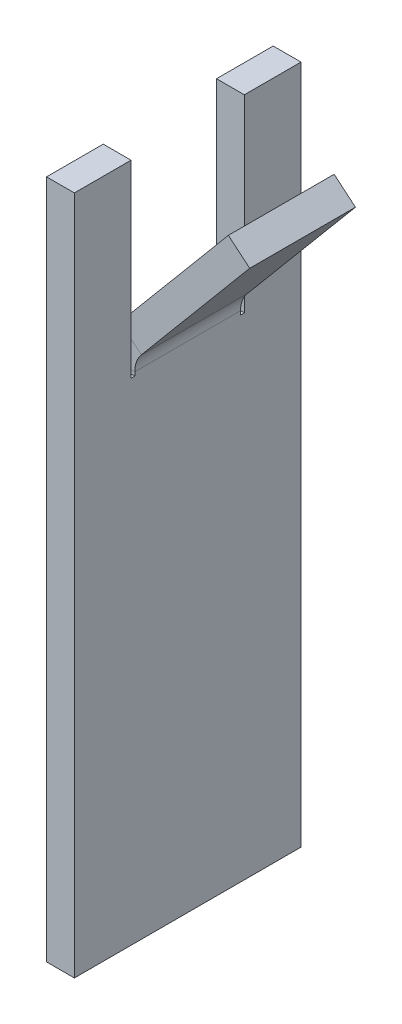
ISO-10303-21;
HEADER;
FILE_DESCRIPTION(('STEP AP214'),'2;1');
FILE_NAME('part.step','',(''),(''),'','','');
FILE_SCHEMA(('AUTOMOTIVE_DESIGN { 1 0 10303 214 1 1 1 1 }'));
ENDSEC;
DATA;
#1=APPLICATION_CONTEXT('core data for automotive mechanical design processes');
#2=APPLICATION_PROTOCOL_DEFINITION('international standard','automotive_design',2000,#1);
#3=PRODUCT_CONTEXT('',#1,'mechanical');
#4=PRODUCT('Part','Part','',(#3));
#5=PRODUCT_RELATED_PRODUCT_CATEGORY('part','',(#4));
#6=PRODUCT_DEFINITION_FORMATION('','',#4);
#7=PRODUCT_DEFINITION_CONTEXT('part definition',#1,'design');
#8=PRODUCT_DEFINITION('design','',#6,#7);
#9=PRODUCT_DEFINITION_SHAPE('','',#8);
#10=(LENGTH_UNIT() NAMED_UNIT(*) SI_UNIT(.MILLI.,.METRE.));
#11=(NAMED_UNIT(*) PLANE_ANGLE_UNIT() SI_UNIT($,.RADIAN.));
#12=(NAMED_UNIT(*) SI_UNIT($,.STERADIAN.) SOLID_ANGLE_UNIT());
#13=UNCERTAINTY_MEASURE_WITH_UNIT(LENGTH_MEASURE(1.E-05),#10,'distance_accuracy_value','');
#14=(GEOMETRIC_REPRESENTATION_CONTEXT(3) GLOBAL_UNCERTAINTY_ASSIGNED_CONTEXT((#13)) GLOBAL_UNIT_ASSIGNED_CONTEXT((#10,
#11,#12)) REPRESENTATION_CONTEXT('',''));
#15=CARTESIAN_POINT('',(0.,0.,0.));
#16=DIRECTION('',(0.,0.,1.));
#17=DIRECTION('',(1.,0.,0.));
#18=AXIS2_PLACEMENT_3D('',#15,#16,#17);
#19=CARTESIAN_POINT('',(-0.7366,0.,0.));
#20=DIRECTION('',(0.,0.,1.));
#21=DIRECTION('',(1.,0.,0.));
#22=AXIS2_PLACEMENT_3D('',#19,#20,#21);
#23=PLANE('',#22);
#24=DIRECTION('',(0.,-1.,0.));
#25=VECTOR('',#24,1.);
#26=CARTESIAN_POINT('',(0.,0.,0.));
#27=LINE('',#26,#25);
#28=CARTESIAN_POINT('',(0.,18.,0.));
#29=VERTEX_POINT('',#28);
#30=CARTESIAN_POINT('',(0.,0.,0.));
#31=VERTEX_POINT('',#30);
#32=EDGE_CURVE('E175',#29,#31,#27,.T.);
#33=ORIENTED_EDGE('',*,*,#32,.F.);
#34=DIRECTION('',(1.,0.,0.));
#35=VECTOR('',#34,1.);
#36=CARTESIAN_POINT('',(-0.7366,18.,0.));
#37=LINE('',#36,#35);
#38=CARTESIAN_POINT('',(-0.7366,18.,0.));
#39=VERTEX_POINT('',#38);
#40=EDGE_CURVE('E13',#39,#29,#37,.T.);
#41=ORIENTED_EDGE('',*,*,#40,.F.);
#42=DIRECTION('',(0.,-1.,0.));
#43=VECTOR('',#42,1.);
#44=CARTESIAN_POINT('',(-0.7366,0.,0.));
#45=LINE('',#44,#43);
#46=CARTESIAN_POINT('',(-0.7366,0.,0.));
#47=VERTEX_POINT('',#46);
#48=EDGE_CURVE('E208',#39,#47,#45,.T.);
#49=ORIENTED_EDGE('',*,*,#48,.T.);
#50=DIRECTION('',(1.,0.,0.));
#51=VECTOR('',#50,1.);
#52=CARTESIAN_POINT('',(-0.7366,0.,0.));
#53=LINE('',#52,#51);
#54=EDGE_CURVE('E56',#47,#31,#53,.T.);
#55=ORIENTED_EDGE('',*,*,#54,.T.);
#56=EDGE_LOOP('',(#33,#41,#49,#55));
#57=FACE_BOUND('',#56,.T.);
#58=ADVANCED_FACE('F53',(#57),#23,.T.);
#59=CARTESIAN_POINT('',(-0.7366,18.,0.));
#60=DIRECTION('',(0.,1.,0.));
#61=DIRECTION('',(0.,0.,1.));
#62=AXIS2_PLACEMENT_3D('',#59,#60,#61);
#63=PLANE('',#62);
#64=DIRECTION('',(0.,0.,1.));
#65=VECTOR('',#64,1.);
#66=CARTESIAN_POINT('',(0.,18.,0.));
#67=LINE('',#66,#65);
#68=CARTESIAN_POINT('',(0.,18.,-1.5));
#69=VERTEX_POINT('',#68);
#70=EDGE_CURVE('E206',#69,#29,#67,.T.);
#71=ORIENTED_EDGE('',*,*,#70,.F.);
#72=DIRECTION('',(1.,0.,0.));
#73=VECTOR('',#72,1.);
#74=CARTESIAN_POINT('',(-0.7366,18.,-1.5));
#75=LINE('',#74,#73);
#76=CARTESIAN_POINT('',(-0.7366,18.,-1.5));
#77=VERTEX_POINT('',#76);
#78=EDGE_CURVE('E62',#77,#69,#75,.T.);
#79=ORIENTED_EDGE('',*,*,#78,.F.);
#80=DIRECTION('',(0.,0.,1.));
#81=VECTOR('',#80,1.);
#82=CARTESIAN_POINT('',(-0.7366,18.,0.));
#83=LINE('',#82,#81);
#84=EDGE_CURVE('E165',#77,#39,#83,.T.);
#85=ORIENTED_EDGE('',*,*,#84,.T.);
#86=ORIENTED_EDGE('',*,*,#40,.T.);
#87=EDGE_LOOP('',(#71,#79,#85,#86));
#88=FACE_BOUND('',#87,.T.);
#89=ADVANCED_FACE('F229',(#88),#63,.T.);
#90=CARTESIAN_POINT('',(-0.7366,18.,-1.5));
#91=DIRECTION('',(0.,0.,-1.));
#92=DIRECTION('',(0.,1.,0.));
#93=AXIS2_PLACEMENT_3D('',#90,#91,#92);
#94=PLANE('',#93);
#95=DIRECTION('',(0.,1.,0.));
#96=VECTOR('',#95,1.);
#97=CARTESIAN_POINT('',(0.,18.,-1.5));
#98=LINE('',#97,#96);
#99=CARTESIAN_POINT('',(0.,13.,-1.5));
#100=VERTEX_POINT('',#99);
#101=EDGE_CURVE('E152',#100,#69,#98,.T.);
#102=ORIENTED_EDGE('',*,*,#101,.F.);
#103=DIRECTION('',(1.,0.,0.));
#104=VECTOR('',#103,1.);
#105=CARTESIAN_POINT('',(-0.7366,13.,-1.5));
#106=LINE('',#105,#104);
#107=CARTESIAN_POINT('',(-0.7366,13.,-1.5));
#108=VERTEX_POINT('',#107);
#109=EDGE_CURVE('E147',#108,#100,#106,.T.);
#110=ORIENTED_EDGE('',*,*,#109,.F.);
#111=DIRECTION('',(0.,1.,0.));
#112=VECTOR('',#111,1.);
#113=CARTESIAN_POINT('',(-0.7366,18.,-1.5));
#114=LINE('',#113,#112);
#115=EDGE_CURVE('E150',#108,#77,#114,.T.);
#116=ORIENTED_EDGE('',*,*,#115,.T.);
#117=ORIENTED_EDGE('',*,*,#78,.T.);
#118=EDGE_LOOP('',(#102,#110,#116,#117));
#119=FACE_BOUND('',#118,.T.);
#120=ADVANCED_FACE('F149',(#119),#94,.T.);
#121=CARTESIAN_POINT('',(-0.7366,13.,-1.5));
#122=DIRECTION('',(0.,1.,0.));
#123=DIRECTION('',(0.,0.,1.));
#124=AXIS2_PLACEMENT_3D('',#121,#122,#123);
#125=PLANE('',#124);
#126=DIRECTION('',(0.,0.,1.));
#127=VECTOR('',#126,1.);
#128=CARTESIAN_POINT('',(0.,13.,-1.5));
#129=LINE('',#128,#127);
#130=CARTESIAN_POINT('',(0.,13.,-1.6));
#131=VERTEX_POINT('',#130);
#132=EDGE_CURVE('E203',#131,#100,#129,.T.);
#133=ORIENTED_EDGE('',*,*,#132,.F.);
#134=DIRECTION('',(1.,0.,0.));
#135=VECTOR('',#134,1.);
#136=CARTESIAN_POINT('',(-0.7366,13.,-1.6));
#137=LINE('',#136,#135);
#138=CARTESIAN_POINT('',(-0.7366,13.,-1.6));
#139=VERTEX_POINT('',#138);
#140=EDGE_CURVE('E157',#139,#131,#137,.T.);
#141=ORIENTED_EDGE('',*,*,#140,.F.);
#142=DIRECTION('',(0.,0.,1.));
#143=VECTOR('',#142,1.);
#144=CARTESIAN_POINT('',(-0.7366,13.,-1.5));
#145=LINE('',#144,#143);
#146=EDGE_CURVE('E163',#139,#108,#145,.T.);
#147=ORIENTED_EDGE('',*,*,#146,.T.);
#148=ORIENTED_EDGE('',*,*,#109,.T.);
#149=EDGE_LOOP('',(#133,#141,#147,#148));
#150=FACE_BOUND('',#149,.T.);
#151=ADVANCED_FACE('F167',(#150),#125,.T.);
#152=CARTESIAN_POINT('',(-0.7366,13.1,-1.6));
#153=DIRECTION('',(0.,0.,1.));
#154=DIRECTION('',(0.,-1.,0.));
#155=AXIS2_PLACEMENT_3D('',#152,#153,#154);
#156=PLANE('',#155);
#157=DIRECTION('',(0.,-1.,0.));
#158=VECTOR('',#157,1.);
#159=CARTESIAN_POINT('',(0.,13.1,-1.6));
#160=LINE('',#159,#158);
#161=CARTESIAN_POINT('',(0.,13.1,-1.6));
#162=VERTEX_POINT('',#161);
#163=EDGE_CURVE('E200',#162,#131,#160,.T.);
#164=ORIENTED_EDGE('',*,*,#163,.F.);
#165=DIRECTION('',(1.,0.,0.));
#166=VECTOR('',#165,1.);
#167=CARTESIAN_POINT('',(-0.7366,13.1,-1.6));
#168=LINE('',#167,#166);
#169=CARTESIAN_POINT('',(-0.736599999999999,13.1,-1.6));
#170=VERTEX_POINT('',#169);
#171=EDGE_CURVE('E212',#170,#162,#168,.T.);
#172=ORIENTED_EDGE('',*,*,#171,.F.);
#173=DIRECTION('',(0.,-1.,0.));
#174=VECTOR('',#173,1.);
#175=CARTESIAN_POINT('',(-0.7366,13.1,-1.6));
#176=LINE('',#175,#174);
#177=EDGE_CURVE('E168',#170,#139,#176,.T.);
#178=ORIENTED_EDGE('',*,*,#177,.T.);
#179=ORIENTED_EDGE('',*,*,#140,.T.);
#180=EDGE_LOOP('',(#164,#172,#178,#179));
#181=FACE_BOUND('',#180,.T.);
#182=ADVANCED_FACE('F242',(#181),#156,.T.);
#183=CARTESIAN_POINT('',(-0.7366,13.1,-4.40000000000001));
#184=DIRECTION('',(0.,0.,-1.));
#185=DIRECTION('',(-1.,0.,0.));
#186=AXIS2_PLACEMENT_3D('',#183,#184,#185);
#187=PLANE('',#186);
#188=DIRECTION('',(0.,1.,0.));
#189=VECTOR('',#188,1.);
#190=CARTESIAN_POINT('',(0.,13.1,-4.40000000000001));
#191=LINE('',#190,#189);
#192=CARTESIAN_POINT('',(0.,13.,-4.40000000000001));
#193=VERTEX_POINT('',#192);
#194=CARTESIAN_POINT('',(0.,13.1,-4.40000000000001));
#195=VERTEX_POINT('',#194);
#196=EDGE_CURVE('E194',#193,#195,#191,.T.);
#197=ORIENTED_EDGE('',*,*,#196,.F.);
#198=DIRECTION('',(1.,0.,0.));
#199=VECTOR('',#198,1.);
#200=CARTESIAN_POINT('',(-0.7366,13.,-4.40000000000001));
#201=LINE('',#200,#199);
#202=CARTESIAN_POINT('',(-0.7366,13.,-4.40000000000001));
#203=VERTEX_POINT('',#202);
#204=EDGE_CURVE('E217',#203,#193,#201,.T.);
#205=ORIENTED_EDGE('',*,*,#204,.F.);
#206=DIRECTION('',(0.,1.,0.));
#207=VECTOR('',#206,1.);
#208=CARTESIAN_POINT('',(-0.7366,13.1,-4.40000000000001));
#209=LINE('',#208,#207);
#210=CARTESIAN_POINT('',(-0.7366,13.1,-4.40000000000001));
#211=VERTEX_POINT('',#210);
#212=EDGE_CURVE('E378',#203,#211,#209,.T.);
#213=ORIENTED_EDGE('',*,*,#212,.T.);
#214=DIRECTION('',(1.,0.,0.));
#215=VECTOR('',#214,1.);
#216=CARTESIAN_POINT('',(-0.7366,13.1,-4.40000000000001));
#217=LINE('',#216,#215);
#218=EDGE_CURVE('E215',#211,#195,#217,.T.);
#219=ORIENTED_EDGE('',*,*,#218,.T.);
#220=EDGE_LOOP('',(#197,#205,#213,#219));
#221=FACE_BOUND('',#220,.T.);
#222=ADVANCED_FACE('F245',(#221),#187,.T.);
#223=CARTESIAN_POINT('',(-0.7366,13.,-4.40000000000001));
#224=DIRECTION('',(0.,1.,0.));
#225=DIRECTION('',(0.,0.,1.));
#226=AXIS2_PLACEMENT_3D('',#223,#224,#225);
#227=PLANE('',#226);
#228=DIRECTION('',(0.,0.,1.));
#229=VECTOR('',#228,1.);
#230=CARTESIAN_POINT('',(0.,13.,-4.40000000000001));
#231=LINE('',#230,#229);
#232=CARTESIAN_POINT('',(0.,13.,-4.50000000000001));
#233=VERTEX_POINT('',#232);
#234=EDGE_CURVE('E191',#233,#193,#231,.T.);
#235=ORIENTED_EDGE('',*,*,#234,.F.);
#236=DIRECTION('',(1.,0.,0.));
#237=VECTOR('',#236,1.);
#238=CARTESIAN_POINT('',(-0.7366,13.,-4.50000000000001));
#239=LINE('',#238,#237);
#240=CARTESIAN_POINT('',(-0.7366,13.,-4.50000000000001));
#241=VERTEX_POINT('',#240);
#242=EDGE_CURVE('E219',#241,#233,#239,.T.);
#243=ORIENTED_EDGE('',*,*,#242,.F.);
#244=DIRECTION('',(0.,0.,1.));
#245=VECTOR('',#244,1.);
#246=CARTESIAN_POINT('',(-0.7366,13.,-4.40000000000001));
#247=LINE('',#246,#245);
#248=EDGE_CURVE('E375',#241,#203,#247,.T.);
#249=ORIENTED_EDGE('',*,*,#248,.T.);
#250=ORIENTED_EDGE('',*,*,#204,.T.);
#251=EDGE_LOOP('',(#235,#243,#249,#250));
#252=FACE_BOUND('',#251,.T.);
#253=ADVANCED_FACE('F249',(#252),#227,.T.);
#254=CARTESIAN_POINT('',(-0.7366,18.,-4.50000000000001));
#255=DIRECTION('',(0.,0.,1.));
#256=DIRECTION('',(0.,-1.,0.));
#257=AXIS2_PLACEMENT_3D('',#254,#255,#256);
#258=PLANE('',#257);
#259=DIRECTION('',(0.,-1.,0.));
#260=VECTOR('',#259,1.);
#261=CARTESIAN_POINT('',(0.,18.,-4.50000000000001));
#262=LINE('',#261,#260);
#263=CARTESIAN_POINT('',(0.,18.,-4.50000000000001));
#264=VERTEX_POINT('',#263);
#265=EDGE_CURVE('E188',#264,#233,#262,.T.);
#266=ORIENTED_EDGE('',*,*,#265,.F.);
#267=DIRECTION('',(1.,0.,0.));
#268=VECTOR('',#267,1.);
#269=CARTESIAN_POINT('',(-0.7366,18.,-4.50000000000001));
#270=LINE('',#269,#268);
#271=CARTESIAN_POINT('',(-0.7366,18.,-4.50000000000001));
#272=VERTEX_POINT('',#271);
#273=EDGE_CURVE('E221',#272,#264,#270,.T.);
#274=ORIENTED_EDGE('',*,*,#273,.F.);
#275=DIRECTION('',(0.,-1.,0.));
#276=VECTOR('',#275,1.);
#277=CARTESIAN_POINT('',(-0.7366,18.,-4.50000000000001));
#278=LINE('',#277,#276);
#279=EDGE_CURVE('E372',#272,#241,#278,.T.);
#280=ORIENTED_EDGE('',*,*,#279,.T.);
#281=ORIENTED_EDGE('',*,*,#242,.T.);
#282=EDGE_LOOP('',(#266,#274,#280,#281));
#283=FACE_BOUND('',#282,.T.);
#284=ADVANCED_FACE('F253',(#283),#258,.T.);
#285=CARTESIAN_POINT('',(-0.7366,18.,-4.50000000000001));
#286=DIRECTION('',(0.,1.,0.));
#287=DIRECTION('',(0.,0.,1.));
#288=AXIS2_PLACEMENT_3D('',#285,#286,#287);
#289=PLANE('',#288);
#290=DIRECTION('',(0.,0.,1.));
#291=VECTOR('',#290,1.);
#292=CARTESIAN_POINT('',(0.,18.,-4.50000000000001));
#293=LINE('',#292,#291);
#294=CARTESIAN_POINT('',(0.,18.,-6.));
#295=VERTEX_POINT('',#294);
#296=EDGE_CURVE('E185',#295,#264,#293,.T.);
#297=ORIENTED_EDGE('',*,*,#296,.F.);
#298=DIRECTION('',(1.,0.,0.));
#299=VECTOR('',#298,1.);
#300=CARTESIAN_POINT('',(-0.7366,18.,-6.));
#301=LINE('',#300,#299);
#302=CARTESIAN_POINT('',(-0.7366,18.,-6.));
#303=VERTEX_POINT('',#302);
#304=EDGE_CURVE('E223',#303,#295,#301,.T.);
#305=ORIENTED_EDGE('',*,*,#304,.F.);
#306=DIRECTION('',(0.,0.,1.));
#307=VECTOR('',#306,1.);
#308=CARTESIAN_POINT('',(-0.7366,18.,-4.50000000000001));
#309=LINE('',#308,#307);
#310=EDGE_CURVE('E369',#303,#272,#309,.T.);
#311=ORIENTED_EDGE('',*,*,#310,.T.);
#312=ORIENTED_EDGE('',*,*,#273,.T.);
#313=EDGE_LOOP('',(#297,#305,#311,#312));
#314=FACE_BOUND('',#313,.T.);
#315=ADVANCED_FACE('F257',(#314),#289,.T.);
#316=CARTESIAN_POINT('',(-0.7366,0.,-6.));
#317=DIRECTION('',(0.,0.,-1.));
#318=DIRECTION('',(0.,1.,0.));
#319=AXIS2_PLACEMENT_3D('',#316,#317,#318);
#320=PLANE('',#319);
#321=DIRECTION('',(0.,1.,0.));
#322=VECTOR('',#321,1.);
#323=CARTESIAN_POINT('',(0.,0.,-6.));
#324=LINE('',#323,#322);
#325=CARTESIAN_POINT('',(0.,0.,-6.));
#326=VERTEX_POINT('',#325);
#327=EDGE_CURVE('E182',#326,#295,#324,.T.);
#328=ORIENTED_EDGE('',*,*,#327,.F.);
#329=DIRECTION('',(1.,0.,0.));
#330=VECTOR('',#329,1.);
#331=CARTESIAN_POINT('',(-0.7366,0.,-6.));
#332=LINE('',#331,#330);
#333=CARTESIAN_POINT('',(-0.7366,0.,-6.));
#334=VERTEX_POINT('',#333);
#335=EDGE_CURVE('E224',#334,#326,#332,.T.);
#336=ORIENTED_EDGE('',*,*,#335,.F.);
#337=DIRECTION('',(0.,1.,0.));
#338=VECTOR('',#337,1.);
#339=CARTESIAN_POINT('',(-0.7366,0.,-6.));
#340=LINE('',#339,#338);
#341=EDGE_CURVE('E366',#334,#303,#340,.T.);
#342=ORIENTED_EDGE('',*,*,#341,.T.);
#343=ORIENTED_EDGE('',*,*,#304,.T.);
#344=EDGE_LOOP('',(#328,#336,#342,#343));
#345=FACE_BOUND('',#344,.T.);
#346=ADVANCED_FACE('F261',(#345),#320,.T.);
#347=CARTESIAN_POINT('',(-0.7366,0.,0.));
#348=DIRECTION('',(0.,-1.,0.));
#349=DIRECTION('',(0.,0.,-1.));
#350=AXIS2_PLACEMENT_3D('',#347,#348,#349);
#351=PLANE('',#350);
#352=DIRECTION('',(0.,0.,-1.));
#353=VECTOR('',#352,1.);
#354=CARTESIAN_POINT('',(0.,0.,0.));
#355=LINE('',#354,#353);
#356=EDGE_CURVE('E178',#31,#326,#355,.T.);
#357=ORIENTED_EDGE('',*,*,#356,.F.);
#358=ORIENTED_EDGE('',*,*,#54,.F.);
#359=DIRECTION('',(0.,0.,-1.));
#360=VECTOR('',#359,1.);
#361=CARTESIAN_POINT('',(-0.7366,0.,0.));
#362=LINE('',#361,#360);
#363=EDGE_CURVE('E364',#47,#334,#362,.T.);
#364=ORIENTED_EDGE('',*,*,#363,.T.);
#365=ORIENTED_EDGE('',*,*,#335,.T.);
#366=EDGE_LOOP('',(#357,#358,#364,#365));
#367=FACE_BOUND('',#366,.T.);
#368=ADVANCED_FACE('F226',(#367),#351,.T.);
#369=CARTESIAN_POINT('',(-0.7366,18.,0.));
#370=DIRECTION('',(-1.,0.,0.));
#371=DIRECTION('',(0.,0.,1.));
#372=AXIS2_PLACEMENT_3D('',#369,#370,#371);
#373=PLANE('',#372);
#374=ORIENTED_EDGE('',*,*,#48,.F.);
#375=ORIENTED_EDGE('',*,*,#84,.F.);
#376=ORIENTED_EDGE('',*,*,#115,.F.);
#377=ORIENTED_EDGE('',*,*,#146,.F.);
#378=ORIENTED_EDGE('',*,*,#177,.F.);
#379=DIRECTION('',(0.,0.,1.));
#380=VECTOR('',#379,1.);
#381=CARTESIAN_POINT('',(-0.7366,13.1,-1.6));
#382=LINE('',#381,#380);
#383=EDGE_CURVE('E170',#211,#170,#382,.T.);
#384=ORIENTED_EDGE('',*,*,#383,.F.);
#385=ORIENTED_EDGE('',*,*,#212,.F.);
#386=ORIENTED_EDGE('',*,*,#248,.F.);
#387=ORIENTED_EDGE('',*,*,#279,.F.);
#388=ORIENTED_EDGE('',*,*,#310,.F.);
#389=ORIENTED_EDGE('',*,*,#341,.F.);
#390=ORIENTED_EDGE('',*,*,#363,.F.);
#391=EDGE_LOOP('',(#374,#375,#376,#377,#378,#384,#385,#386,#387,#388,#389,#390));
#392=FACE_BOUND('',#391,.T.);
#393=ADVANCED_FACE('F161',(#392),#373,.T.);
#394=CARTESIAN_POINT('',(0.,18.,0.));
#395=DIRECTION('',(-1.,0.,0.));
#396=DIRECTION('',(0.,0.,1.));
#397=AXIS2_PLACEMENT_3D('',#394,#395,#396);
#398=PLANE('',#397);
#399=ORIENTED_EDGE('',*,*,#32,.T.);
#400=ORIENTED_EDGE('',*,*,#356,.T.);
#401=ORIENTED_EDGE('',*,*,#327,.T.);
#402=ORIENTED_EDGE('',*,*,#296,.T.);
#403=ORIENTED_EDGE('',*,*,#265,.T.);
#404=ORIENTED_EDGE('',*,*,#234,.T.);
#405=ORIENTED_EDGE('',*,*,#196,.T.);
#406=DIRECTION('',(0.,0.,1.));
#407=VECTOR('',#406,1.);
#408=CARTESIAN_POINT('',(0.,13.1,-1.6));
#409=LINE('',#408,#407);
#410=EDGE_CURVE('E197',#195,#162,#409,.T.);
#411=ORIENTED_EDGE('',*,*,#410,.T.);
#412=ORIENTED_EDGE('',*,*,#163,.T.);
#413=ORIENTED_EDGE('',*,*,#132,.T.);
#414=ORIENTED_EDGE('',*,*,#101,.T.);
#415=ORIENTED_EDGE('',*,*,#70,.T.);
#416=EDGE_LOOP('',(#399,#400,#401,#402,#403,#404,#405,#411,#412,#413,#414,#415));
#417=FACE_BOUND('',#416,.T.);
#418=ADVANCED_FACE('F228',(#417),#398,.F.);
#419=CARTESIAN_POINT('',(0.736600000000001,13.1,-4.40000000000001));
#420=DIRECTION('',(0.,0.,-1.));
#421=DIRECTION('',(-1.,0.,0.));
#422=AXIS2_PLACEMENT_3D('',#419,#420,#421);
#423=PLANE('',#422);
#424=DIRECTION('',(-0.766044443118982,0.642787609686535,0.));
#425=VECTOR('',#424,1.);
#426=CARTESIAN_POINT('',(-0.391936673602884,14.0469547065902,-4.40000000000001));
#427=LINE('',#426,#425);
#428=CARTESIAN_POINT('',(0.172331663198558,13.5734773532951,-4.40000000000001));
#429=VERTEX_POINT('',#428);
#430=CARTESIAN_POINT('',(-0.391936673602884,14.0469547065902,-4.40000000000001));
#431=VERTEX_POINT('',#430);
#432=EDGE_CURVE('E349',#429,#431,#427,.T.);
#433=ORIENTED_EDGE('',*,*,#432,.F.);
#434=CARTESIAN_POINT('',(0.736600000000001,13.1,-4.40000000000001));
#435=DIRECTION('',(0.,0.,1.));
#436=DIRECTION('',(1.,0.,0.));
#437=AXIS2_PLACEMENT_3D('',#434,#435,#436);
#438=CIRCLE('',#437,0.7366);
#439=EDGE_CURVE('E356',#195,#429,#438,.F.);
#440=ORIENTED_EDGE('',*,*,#439,.F.);
#441=ORIENTED_EDGE('',*,*,#218,.F.);
#442=CARTESIAN_POINT('',(0.736600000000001,13.1,-4.40000000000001));
#443=DIRECTION('',(0.,0.,1.));
#444=DIRECTION('',(1.,0.,0.));
#445=AXIS2_PLACEMENT_3D('',#442,#443,#444);
#446=CIRCLE('',#445,1.4732);
#447=EDGE_CURVE('E179',#211,#431,#446,.F.);
#448=ORIENTED_EDGE('',*,*,#447,.T.);
#449=EDGE_LOOP('',(#433,#440,#441,#448));
#450=FACE_BOUND('',#449,.T.);
#451=ADVANCED_FACE('F272',(#450),#423,.T.);
#452=CARTESIAN_POINT('',(0.736600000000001,13.1,-1.6));
#453=DIRECTION('',(0.,0.,-1.));
#454=DIRECTION('',(-1.,0.,0.));
#455=AXIS2_PLACEMENT_3D('',#452,#453,#454);
#456=PLANE('',#455);
#457=CARTESIAN_POINT('',(0.736600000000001,13.1,-1.6));
#458=DIRECTION('',(0.,0.,1.));
#459=DIRECTION('',(1.,0.,0.));
#460=AXIS2_PLACEMENT_3D('',#457,#458,#459);
#461=CIRCLE('',#460,0.7366);
#462=CARTESIAN_POINT('',(0.172331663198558,13.5734773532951,-1.6));
#463=VERTEX_POINT('',#462);
#464=EDGE_CURVE('E359',#463,#162,#461,.T.);
#465=ORIENTED_EDGE('',*,*,#464,.F.);
#466=DIRECTION('',(-0.766044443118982,0.642787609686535,0.));
#467=VECTOR('',#466,1.);
#468=CARTESIAN_POINT('',(0.172331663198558,13.5734773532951,-1.6));
#469=LINE('',#468,#467);
#470=CARTESIAN_POINT('',(-0.391936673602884,14.0469547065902,-1.6));
#471=VERTEX_POINT('',#470);
#472=EDGE_CURVE('E343',#463,#471,#469,.T.);
#473=ORIENTED_EDGE('',*,*,#472,.T.);
#474=CARTESIAN_POINT('',(0.736600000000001,13.1,-1.6));
#475=DIRECTION('',(0.,0.,1.));
#476=DIRECTION('',(1.,0.,0.));
#477=AXIS2_PLACEMENT_3D('',#474,#475,#476);
#478=CIRCLE('',#477,1.4732);
#479=EDGE_CURVE('E353',#471,#170,#478,.T.);
#480=ORIENTED_EDGE('',*,*,#479,.T.);
#481=ORIENTED_EDGE('',*,*,#171,.T.);
#482=EDGE_LOOP('',(#465,#473,#480,#481));
#483=FACE_BOUND('',#482,.T.);
#484=ADVANCED_FACE('F274',(#483),#456,.F.);
#485=CARTESIAN_POINT('',(0.736600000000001,13.1,-1.6));
#486=DIRECTION('',(0.,0.,1.));
#487=DIRECTION('',(-0.766044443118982,0.642787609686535,0.));
#488=AXIS2_PLACEMENT_3D('',#485,#486,#487);
#489=CYLINDRICAL_SURFACE('',#488,1.4732);
#490=ORIENTED_EDGE('',*,*,#383,.T.);
#491=ORIENTED_EDGE('',*,*,#479,.F.);
#492=DIRECTION('',(0.,0.,1.));
#493=VECTOR('',#492,1.);
#494=CARTESIAN_POINT('',(-0.391936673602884,14.0469547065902,-1.6));
#495=LINE('',#494,#493);
#496=EDGE_CURVE('E319',#431,#471,#495,.T.);
#497=ORIENTED_EDGE('',*,*,#496,.F.);
#498=ORIENTED_EDGE('',*,*,#447,.F.);
#499=EDGE_LOOP('',(#490,#491,#497,#498));
#500=FACE_BOUND('',#499,.T.);
#501=ADVANCED_FACE('F277',(#500),#489,.T.);
#502=CARTESIAN_POINT('',(0.736600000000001,13.1,-1.6));
#503=DIRECTION('',(0.,0.,1.));
#504=DIRECTION('',(-0.766044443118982,0.642787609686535,0.));
#505=AXIS2_PLACEMENT_3D('',#502,#503,#504);
#506=CYLINDRICAL_SURFACE('',#505,0.7366);
#507=ORIENTED_EDGE('',*,*,#410,.F.);
#508=ORIENTED_EDGE('',*,*,#439,.T.);
#509=DIRECTION('',(0.,0.,-1.));
#510=VECTOR('',#509,1.);
#511=CARTESIAN_POINT('',(0.172331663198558,13.5734773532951,-4.40000000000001));
#512=LINE('',#511,#510);
#513=EDGE_CURVE('E346',#429,#463,#512,.F.);
#514=ORIENTED_EDGE('',*,*,#513,.T.);
#515=ORIENTED_EDGE('',*,*,#464,.T.);
#516=EDGE_LOOP('',(#507,#508,#514,#515));
#517=FACE_BOUND('',#516,.T.);
#518=ADVANCED_FACE('F279',(#517),#506,.F.);
#519=CARTESIAN_POINT('',(-0.564268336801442,13.8415778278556,-1.6));
#520=DIRECTION('',(0.,0.,1.));
#521=DIRECTION('',(1.,0.,0.));
#522=AXIS2_PLACEMENT_3D('',#519,#520,#521);
#523=PLANE('',#522);
#524=DIRECTION('',(-0.642787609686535,-0.766044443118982,0.));
#525=VECTOR('',#524,1.);
#526=CARTESIAN_POINT('',(-0.564268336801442,13.8415778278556,-1.6));
#527=LINE('',#526,#525);
#528=CARTESIAN_POINT('',(2.47733804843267,17.4664231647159,-1.6));
#529=VERTEX_POINT('',#528);
#530=EDGE_CURVE('E330',#529,#471,#527,.T.);
#531=ORIENTED_EDGE('',*,*,#530,.T.);
#532=ORIENTED_EDGE('',*,*,#472,.F.);
#533=DIRECTION('',(0.642787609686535,0.766044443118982,0.));
#534=VECTOR('',#533,1.);
#535=CARTESIAN_POINT('',(0.,13.3681004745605,-1.6));
#536=LINE('',#535,#534);
#537=CARTESIAN_POINT('',(3.04160638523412,16.9929458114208,-1.6));
#538=VERTEX_POINT('',#537);
#539=EDGE_CURVE('E328',#538,#463,#536,.F.);
#540=ORIENTED_EDGE('',*,*,#539,.F.);
#541=DIRECTION('',(0.766044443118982,-0.642787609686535,0.));
#542=VECTOR('',#541,1.);
#543=CARTESIAN_POINT('',(2.47733804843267,17.4664231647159,-1.6));
#544=LINE('',#543,#542);
#545=EDGE_CURVE('E362',#529,#538,#544,.T.);
#546=ORIENTED_EDGE('',*,*,#545,.F.);
#547=EDGE_LOOP('',(#531,#532,#540,#546));
#548=FACE_BOUND('',#547,.T.);
#549=ADVANCED_FACE('F285',(#548),#523,.T.);
#550=CARTESIAN_POINT('',(2.47733804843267,17.4664231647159,-4.40000000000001));
#551=DIRECTION('',(0.,0.,-1.));
#552=DIRECTION('',(-1.,0.,0.));
#553=AXIS2_PLACEMENT_3D('',#550,#551,#552);
#554=PLANE('',#553);
#555=DIRECTION('',(-0.642787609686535,-0.766044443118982,0.));
#556=VECTOR('',#555,1.);
#557=CARTESIAN_POINT('',(0.,13.3681004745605,-4.40000000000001));
#558=LINE('',#557,#556);
#559=CARTESIAN_POINT('',(3.04160638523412,16.9929458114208,-4.40000000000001));
#560=VERTEX_POINT('',#559);
#561=EDGE_CURVE('E339',#429,#560,#558,.F.);
#562=ORIENTED_EDGE('',*,*,#561,.F.);
#563=ORIENTED_EDGE('',*,*,#432,.T.);
#564=DIRECTION('',(0.642787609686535,0.766044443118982,0.));
#565=VECTOR('',#564,1.);
#566=CARTESIAN_POINT('',(2.47733804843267,17.4664231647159,-4.40000000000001));
#567=LINE('',#566,#565);
#568=CARTESIAN_POINT('',(2.47733804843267,17.4664231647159,-4.40000000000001));
#569=VERTEX_POINT('',#568);
#570=EDGE_CURVE('E315',#431,#569,#567,.T.);
#571=ORIENTED_EDGE('',*,*,#570,.T.);
#572=DIRECTION('',(0.766044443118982,-0.642787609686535,0.));
#573=VECTOR('',#572,1.);
#574=CARTESIAN_POINT('',(2.47733804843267,17.4664231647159,-4.40000000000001));
#575=LINE('',#574,#573);
#576=EDGE_CURVE('E404',#569,#560,#575,.T.);
#577=ORIENTED_EDGE('',*,*,#576,.T.);
#578=EDGE_LOOP('',(#562,#563,#571,#577));
#579=FACE_BOUND('',#578,.T.);
#580=ADVANCED_FACE('F290',(#579),#554,.T.);
#581=CARTESIAN_POINT('',(-0.564268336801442,13.8415778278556,-1.6));
#582=DIRECTION('',(-0.766044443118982,0.642787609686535,0.));
#583=DIRECTION('',(-0.642787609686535,-0.766044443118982,0.));
#584=AXIS2_PLACEMENT_3D('',#581,#582,#583);
#585=PLANE('',#584);
#586=ORIENTED_EDGE('',*,*,#570,.F.);
#587=ORIENTED_EDGE('',*,*,#496,.T.);
#588=ORIENTED_EDGE('',*,*,#530,.F.);
#589=DIRECTION('',(0.,0.,1.));
#590=VECTOR('',#589,1.);
#591=CARTESIAN_POINT('',(2.47733804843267,17.4664231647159,-1.6));
#592=LINE('',#591,#590);
#593=EDGE_CURVE('E323',#569,#529,#592,.T.);
#594=ORIENTED_EDGE('',*,*,#593,.F.);
#595=EDGE_LOOP('',(#586,#587,#588,#594));
#596=FACE_BOUND('',#595,.T.);
#597=ADVANCED_FACE('F293',(#596),#585,.T.);
#598=CARTESIAN_POINT('',(0.,13.3681004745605,-1.6));
#599=DIRECTION('',(-0.766044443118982,0.642787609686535,0.));
#600=DIRECTION('',(-0.642787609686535,-0.766044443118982,0.));
#601=AXIS2_PLACEMENT_3D('',#598,#599,#600);
#602=PLANE('',#601);
#603=ORIENTED_EDGE('',*,*,#513,.F.);
#604=ORIENTED_EDGE('',*,*,#561,.T.);
#605=DIRECTION('',(0.,0.,-1.));
#606=VECTOR('',#605,1.);
#607=CARTESIAN_POINT('',(3.04160638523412,16.9929458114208,-1.6));
#608=LINE('',#607,#606);
#609=EDGE_CURVE('E333',#560,#538,#608,.F.);
#610=ORIENTED_EDGE('',*,*,#609,.T.);
#611=ORIENTED_EDGE('',*,*,#539,.T.);
#612=EDGE_LOOP('',(#603,#604,#610,#611));
#613=FACE_BOUND('',#612,.T.);
#614=ADVANCED_FACE('F298',(#613),#602,.F.);
#615=CARTESIAN_POINT('',(2.47733804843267,17.4664231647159,-1.6));
#616=DIRECTION('',(0.642787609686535,0.766044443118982,0.));
#617=DIRECTION('',(-0.766044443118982,0.642787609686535,0.));
#618=AXIS2_PLACEMENT_3D('',#615,#616,#617);
#619=PLANE('',#618);
#620=ORIENTED_EDGE('',*,*,#609,.F.);
#621=ORIENTED_EDGE('',*,*,#576,.F.);
#622=ORIENTED_EDGE('',*,*,#593,.T.);
#623=ORIENTED_EDGE('',*,*,#545,.T.);
#624=EDGE_LOOP('',(#620,#621,#622,#623));
#625=FACE_BOUND('',#624,.T.);
#626=ADVANCED_FACE('F295',(#625),#619,.T.);
#627=CLOSED_SHELL('',(#58,#89,#120,#151,#182,#222,#253,#284,#315,#346,#368,#393,#418,#451,#484,
#501,#518,#549,#580,#597,#614,#626));
#628=MANIFOLD_SOLID_BREP('B2',#627);
#629=ADVANCED_BREP_SHAPE_REPRESENTATION('',(#18,#628),#14);
#630=SHAPE_DEFINITION_REPRESENTATION(#9,#629);
ENDSEC;
END-ISO-10303-21;
